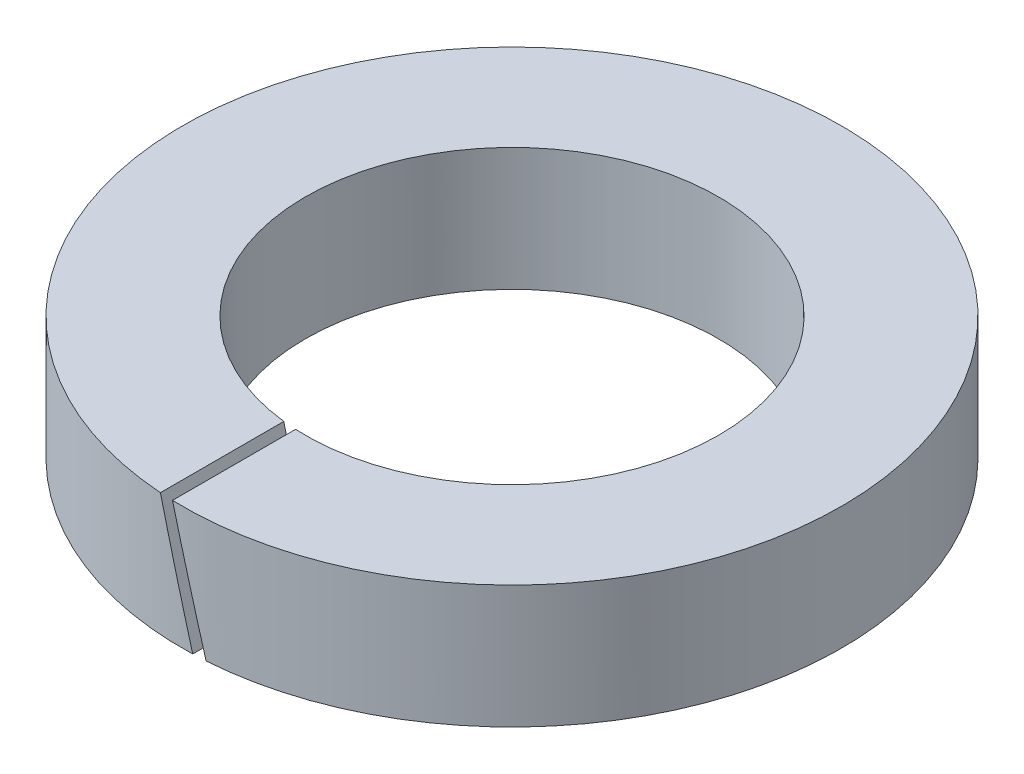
ISO-10303-21;
HEADER;
FILE_DESCRIPTION(('STEP AP214'),'2;1');
FILE_NAME('part.step','',(''),(''),'','','');
FILE_SCHEMA(('AUTOMOTIVE_DESIGN { 1 0 10303 214 1 1 1 1 }'));
ENDSEC;
DATA;
#1=APPLICATION_CONTEXT('core data for automotive mechanical design processes');
#2=APPLICATION_PROTOCOL_DEFINITION('international standard','automotive_design',2000,#1);
#3=PRODUCT_CONTEXT('',#1,'mechanical');
#4=PRODUCT('Part','Part','',(#3));
#5=PRODUCT_RELATED_PRODUCT_CATEGORY('part','',(#4));
#6=PRODUCT_DEFINITION_FORMATION('','',#4);
#7=PRODUCT_DEFINITION_CONTEXT('part definition',#1,'design');
#8=PRODUCT_DEFINITION('design','',#6,#7);
#9=PRODUCT_DEFINITION_SHAPE('','',#8);
#10=(LENGTH_UNIT() NAMED_UNIT(*) SI_UNIT(.MILLI.,.METRE.));
#11=(NAMED_UNIT(*) PLANE_ANGLE_UNIT() SI_UNIT($,.RADIAN.));
#12=(NAMED_UNIT(*) SI_UNIT($,.STERADIAN.) SOLID_ANGLE_UNIT());
#13=UNCERTAINTY_MEASURE_WITH_UNIT(LENGTH_MEASURE(1.E-05),#10,'distance_accuracy_value','');
#14=(GEOMETRIC_REPRESENTATION_CONTEXT(3) GLOBAL_UNCERTAINTY_ASSIGNED_CONTEXT((#13)) GLOBAL_UNIT_ASSIGNED_CONTEXT((#10,
#11,#12)) REPRESENTATION_CONTEXT('',''));
#15=CARTESIAN_POINT('',(0.,0.,0.));
#16=DIRECTION('',(0.,0.,1.));
#17=DIRECTION('',(1.,0.,0.));
#18=AXIS2_PLACEMENT_3D('',#15,#16,#17);
#19=CARTESIAN_POINT('',(0.,0.5,0.));
#20=DIRECTION('',(0.,1.,0.));
#21=DIRECTION('',(0.,0.,1.));
#22=AXIS2_PLACEMENT_3D('',#19,#20,#21);
#23=CYLINDRICAL_SURFACE('',#22,4.2);
#24=CARTESIAN_POINT('',(0.,1.73296291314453,0.));
#25=DIRECTION('',(-0.965925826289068,-0.258819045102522,0.));
#26=DIRECTION('',(-0.258819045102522,0.965925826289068,0.));
#27=AXIS2_PLACEMENT_3D('',#24,#25,#26);
#28=ELLIPSE('',#27,16.2275538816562,4.2);
#29=CARTESIAN_POINT('',(0.464346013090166,0.,4.1742523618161));
#30=VERTEX_POINT('',#29);
#31=CARTESIAN_POINT('',(-0.205526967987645,2.5,4.19496825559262));
#32=VERTEX_POINT('',#31);
#33=EDGE_CURVE('E47',#30,#32,#28,.T.);
#34=ORIENTED_EDGE('',*,*,#33,.T.);
#35=CARTESIAN_POINT('',(0.,2.5,0.));
#36=DIRECTION('',(0.,1.,0.));
#37=DIRECTION('',(0.,0.,1.));
#38=AXIS2_PLACEMENT_3D('',#35,#36,#37);
#39=CIRCLE('',#38,4.2);
#40=CARTESIAN_POINT('',(-0.464346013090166,2.5,4.1742523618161));
#41=VERTEX_POINT('',#40);
#42=EDGE_CURVE('E11',#32,#41,#39,.T.);
#43=ORIENTED_EDGE('',*,*,#42,.T.);
#44=CARTESIAN_POINT('',(0.,0.767037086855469,0.));
#45=DIRECTION('',(-0.965925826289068,-0.258819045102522,0.));
#46=DIRECTION('',(-0.258819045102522,0.965925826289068,0.));
#47=AXIS2_PLACEMENT_3D('',#44,#45,#46);
#48=ELLIPSE('',#47,16.2275538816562,4.2);
#49=CARTESIAN_POINT('',(0.205526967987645,0.,4.19496825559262));
#50=VERTEX_POINT('',#49);
#51=EDGE_CURVE('E96',#50,#41,#48,.T.);
#52=ORIENTED_EDGE('',*,*,#51,.F.);
#53=CARTESIAN_POINT('',(0.,0.,0.));
#54=DIRECTION('',(0.,1.,0.));
#55=DIRECTION('',(0.,0.,1.));
#56=AXIS2_PLACEMENT_3D('',#53,#54,#55);
#57=CIRCLE('',#56,4.2);
#58=EDGE_CURVE('E89',#30,#50,#57,.T.);
#59=ORIENTED_EDGE('',*,*,#58,.F.);
#60=EDGE_LOOP('',(#34,#43,#52,#59));
#61=FACE_BOUND('',#60,.T.);
#62=ADVANCED_FACE('F33',(#61),#23,.F.);
#63=CARTESIAN_POINT('',(4.2,2.5,0.));
#64=DIRECTION('',(0.,-1.,0.));
#65=DIRECTION('',(0.,0.,-1.));
#66=AXIS2_PLACEMENT_3D('',#63,#64,#65);
#67=PLANE('',#66);
#68=DIRECTION('',(0.,0.,1.));
#69=VECTOR('',#68,1.);
#70=CARTESIAN_POINT('',(-0.205526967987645,2.5,-6.701));
#71=LINE('',#70,#69);
#72=CARTESIAN_POINT('',(-0.205526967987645,2.5,6.69684691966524));
#73=VERTEX_POINT('',#72);
#74=EDGE_CURVE('E74',#32,#73,#71,.T.);
#75=ORIENTED_EDGE('',*,*,#74,.T.);
#76=CARTESIAN_POINT('',(0.,2.5,0.));
#77=DIRECTION('',(0.,1.,0.));
#78=DIRECTION('',(0.,0.,1.));
#79=AXIS2_PLACEMENT_3D('',#76,#77,#78);
#80=CIRCLE('',#79,6.7);
#81=CARTESIAN_POINT('',(-0.464346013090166,2.5,6.6838897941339));
#82=VERTEX_POINT('',#81);
#83=EDGE_CURVE('E40',#73,#82,#80,.T.);
#84=ORIENTED_EDGE('',*,*,#83,.T.);
#85=DIRECTION('',(0.,0.,1.));
#86=VECTOR('',#85,1.);
#87=CARTESIAN_POINT('',(-0.464346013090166,2.5,-6.701));
#88=LINE('',#87,#86);
#89=EDGE_CURVE('E98',#41,#82,#88,.T.);
#90=ORIENTED_EDGE('',*,*,#89,.F.);
#91=ORIENTED_EDGE('',*,*,#42,.F.);
#92=EDGE_LOOP('',(#75,#84,#90,#91));
#93=FACE_BOUND('',#92,.T.);
#94=ADVANCED_FACE('F84',(#93),#67,.F.);
#95=CARTESIAN_POINT('',(0.,0.5,0.));
#96=DIRECTION('',(0.,1.,0.));
#97=DIRECTION('',(0.,0.,1.));
#98=AXIS2_PLACEMENT_3D('',#95,#96,#97);
#99=CYLINDRICAL_SURFACE('',#98,6.7);
#100=CARTESIAN_POINT('',(0.,1.73296291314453,0.));
#101=DIRECTION('',(-0.965925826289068,-0.258819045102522,0.));
#102=DIRECTION('',(-0.258819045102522,0.965925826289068,0.));
#103=AXIS2_PLACEMENT_3D('',#100,#101,#102);
#104=ELLIPSE('',#103,25.8868121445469,6.7);
#105=CARTESIAN_POINT('',(0.464346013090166,0.,6.6838897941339));
#106=VERTEX_POINT('',#105);
#107=EDGE_CURVE('E71',#73,#106,#104,.F.);
#108=ORIENTED_EDGE('',*,*,#107,.T.);
#109=CARTESIAN_POINT('',(0.,0.,0.));
#110=DIRECTION('',(0.,1.,0.));
#111=DIRECTION('',(0.,0.,1.));
#112=AXIS2_PLACEMENT_3D('',#109,#110,#111);
#113=CIRCLE('',#112,6.7);
#114=CARTESIAN_POINT('',(0.205526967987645,0.,6.69684691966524));
#115=VERTEX_POINT('',#114);
#116=EDGE_CURVE('E88',#106,#115,#113,.T.);
#117=ORIENTED_EDGE('',*,*,#116,.T.);
#118=CARTESIAN_POINT('',(0.,0.767037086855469,0.));
#119=DIRECTION('',(-0.965925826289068,-0.258819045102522,0.));
#120=DIRECTION('',(-0.258819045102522,0.965925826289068,0.));
#121=AXIS2_PLACEMENT_3D('',#118,#119,#120);
#122=ELLIPSE('',#121,25.8868121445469,6.7);
#123=EDGE_CURVE('E55',#82,#115,#122,.F.);
#124=ORIENTED_EDGE('',*,*,#123,.F.);
#125=ORIENTED_EDGE('',*,*,#83,.F.);
#126=EDGE_LOOP('',(#108,#117,#124,#125));
#127=FACE_BOUND('',#126,.T.);
#128=ADVANCED_FACE('F87',(#127),#99,.T.);
#129=CARTESIAN_POINT('',(4.2,0.,0.));
#130=DIRECTION('',(0.,1.,0.));
#131=DIRECTION('',(0.,0.,1.));
#132=AXIS2_PLACEMENT_3D('',#129,#130,#131);
#133=PLANE('',#132);
#134=DIRECTION('',(0.,0.,-1.));
#135=VECTOR('',#134,1.);
#136=CARTESIAN_POINT('',(0.464346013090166,0.,-6.701));
#137=LINE('',#136,#135);
#138=EDGE_CURVE('E75',#106,#30,#137,.T.);
#139=ORIENTED_EDGE('',*,*,#138,.T.);
#140=ORIENTED_EDGE('',*,*,#58,.T.);
#141=DIRECTION('',(0.,0.,-1.));
#142=VECTOR('',#141,1.);
#143=CARTESIAN_POINT('',(0.205526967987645,0.,-6.701));
#144=LINE('',#143,#142);
#145=EDGE_CURVE('E100',#115,#50,#144,.T.);
#146=ORIENTED_EDGE('',*,*,#145,.F.);
#147=ORIENTED_EDGE('',*,*,#116,.F.);
#148=EDGE_LOOP('',(#139,#140,#146,#147));
#149=FACE_BOUND('',#148,.T.);
#150=ADVANCED_FACE('F107',(#149),#133,.F.);
#151=CARTESIAN_POINT('',(-0.120740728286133,1.21764761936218,-6.701));
#152=DIRECTION('',(-0.965925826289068,-0.258819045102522,0.));
#153=DIRECTION('',(0.258819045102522,-0.965925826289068,0.));
#154=AXIS2_PLACEMENT_3D('',#151,#152,#153);
#155=PLANE('',#154);
#156=ORIENTED_EDGE('',*,*,#51,.T.);
#157=ORIENTED_EDGE('',*,*,#89,.T.);
#158=ORIENTED_EDGE('',*,*,#123,.T.);
#159=ORIENTED_EDGE('',*,*,#145,.T.);
#160=EDGE_LOOP('',(#156,#157,#158,#159));
#161=FACE_BOUND('',#160,.T.);
#162=ADVANCED_FACE('F103',(#161),#155,.F.);
#163=CARTESIAN_POINT('',(0.120740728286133,1.28235238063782,-6.701));
#164=DIRECTION('',(-0.965925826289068,-0.258819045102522,0.));
#165=DIRECTION('',(0.258819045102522,-0.965925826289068,0.));
#166=AXIS2_PLACEMENT_3D('',#163,#164,#165);
#167=PLANE('',#166);
#168=ORIENTED_EDGE('',*,*,#138,.F.);
#169=ORIENTED_EDGE('',*,*,#107,.F.);
#170=ORIENTED_EDGE('',*,*,#74,.F.);
#171=ORIENTED_EDGE('',*,*,#33,.F.);
#172=EDGE_LOOP('',(#168,#169,#170,#171));
#173=FACE_BOUND('',#172,.T.);
#174=ADVANCED_FACE('F73',(#173),#167,.T.);
#175=CLOSED_SHELL('',(#62,#94,#128,#150,#162,#174));
#176=MANIFOLD_SOLID_BREP('B2',#175);
#177=ADVANCED_BREP_SHAPE_REPRESENTATION('',(#18,#176),#14);
#178=SHAPE_DEFINITION_REPRESENTATION(#9,#177);
ENDSEC;
END-ISO-10303-21;
